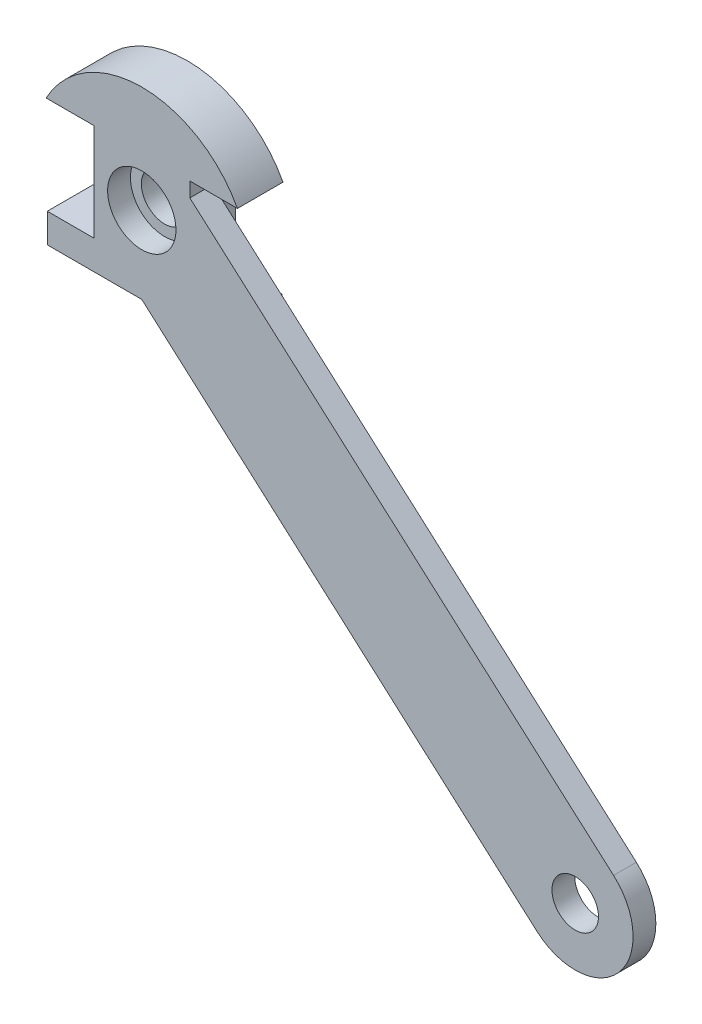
ISO-10303-21;
HEADER;
FILE_DESCRIPTION(('STEP AP214'),'2;1');
FILE_NAME('part.step','',(''),(''),'','','');
FILE_SCHEMA(('AUTOMOTIVE_DESIGN { 1 0 10303 214 1 1 1 1 }'));
ENDSEC;
DATA;
#1=APPLICATION_CONTEXT('core data for automotive mechanical design processes');
#2=APPLICATION_PROTOCOL_DEFINITION('international standard','automotive_design',2000,#1);
#3=PRODUCT_CONTEXT('',#1,'mechanical');
#4=PRODUCT('Part','Part','',(#3));
#5=PRODUCT_RELATED_PRODUCT_CATEGORY('part','',(#4));
#6=PRODUCT_DEFINITION_FORMATION('','',#4);
#7=PRODUCT_DEFINITION_CONTEXT('part definition',#1,'design');
#8=PRODUCT_DEFINITION('design','',#6,#7);
#9=PRODUCT_DEFINITION_SHAPE('','',#8);
#10=(LENGTH_UNIT() NAMED_UNIT(*) SI_UNIT(.MILLI.,.METRE.));
#11=(NAMED_UNIT(*) PLANE_ANGLE_UNIT() SI_UNIT($,.RADIAN.));
#12=(NAMED_UNIT(*) SI_UNIT($,.STERADIAN.) SOLID_ANGLE_UNIT());
#13=UNCERTAINTY_MEASURE_WITH_UNIT(LENGTH_MEASURE(1.E-05),#10,'distance_accuracy_value','');
#14=(GEOMETRIC_REPRESENTATION_CONTEXT(3) GLOBAL_UNCERTAINTY_ASSIGNED_CONTEXT((#13)) GLOBAL_UNIT_ASSIGNED_CONTEXT((#10,
#11,#12)) REPRESENTATION_CONTEXT('',''));
#15=CARTESIAN_POINT('',(0.,0.,0.));
#16=DIRECTION('',(0.,0.,1.));
#17=DIRECTION('',(1.,0.,0.));
#18=AXIS2_PLACEMENT_3D('',#15,#16,#17);
#19=CARTESIAN_POINT('',(-20.74,-16.94245,10.));
#20=DIRECTION('',(0.,1.,0.));
#21=DIRECTION('',(0.,0.,1.));
#22=AXIS2_PLACEMENT_3D('',#19,#20,#21);
#23=PLANE('',#22);
#24=DIRECTION('',(0.,0.,-1.));
#25=VECTOR('',#24,1.);
#26=CARTESIAN_POINT('',(-0.016382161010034,-16.94245,10.));
#27=LINE('',#26,#25);
#28=CARTESIAN_POINT('',(-0.0163821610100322,-16.94245,10.));
#29=VERTEX_POINT('',#28);
#30=CARTESIAN_POINT('',(-0.016382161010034,-16.94245,5.));
#31=VERTEX_POINT('',#30);
#32=EDGE_CURVE('E264',#29,#31,#27,.T.);
#33=ORIENTED_EDGE('',*,*,#32,.F.);
#34=DIRECTION('',(1.,0.,0.));
#35=VECTOR('',#34,1.);
#36=CARTESIAN_POINT('',(-20.74,-16.94245,10.));
#37=LINE('',#36,#35);
#38=CARTESIAN_POINT('',(-20.74,-16.94245,10.));
#39=VERTEX_POINT('',#38);
#40=EDGE_CURVE('E186',#39,#29,#37,.T.);
#41=ORIENTED_EDGE('',*,*,#40,.F.);
#42=DIRECTION('',(0.,0.,-1.));
#43=VECTOR('',#42,1.);
#44=CARTESIAN_POINT('',(-20.74,-16.94245,10.));
#45=LINE('',#44,#43);
#46=CARTESIAN_POINT('',(-20.74,-16.94245,0.));
#47=VERTEX_POINT('',#46);
#48=EDGE_CURVE('E40',#39,#47,#45,.T.);
#49=ORIENTED_EDGE('',*,*,#48,.T.);
#50=DIRECTION('',(1.,0.,0.));
#51=VECTOR('',#50,1.);
#52=CARTESIAN_POINT('',(-20.74,-16.94245,0.));
#53=LINE('',#52,#51);
#54=CARTESIAN_POINT('',(20.74,-16.94245,0.));
#55=VERTEX_POINT('',#54);
#56=EDGE_CURVE('E150',#47,#55,#53,.T.);
#57=ORIENTED_EDGE('',*,*,#56,.T.);
#58=DIRECTION('',(0.,0.,-1.));
#59=VECTOR('',#58,1.);
#60=CARTESIAN_POINT('',(20.74,-16.94245,10.));
#61=LINE('',#60,#59);
#62=CARTESIAN_POINT('',(20.74,-16.94245,5.));
#63=VERTEX_POINT('',#62);
#64=EDGE_CURVE('E178',#63,#55,#61,.T.);
#65=ORIENTED_EDGE('',*,*,#64,.F.);
#66=DIRECTION('',(-1.,0.,0.));
#67=VECTOR('',#66,1.);
#68=CARTESIAN_POINT('',(-20.74,-16.94245,5.));
#69=LINE('',#68,#67);
#70=EDGE_CURVE('E202',#63,#31,#69,.T.);
#71=ORIENTED_EDGE('',*,*,#70,.T.);
#72=EDGE_LOOP('',(#33,#41,#49,#57,#65,#71));
#73=FACE_BOUND('',#72,.T.);
#74=ADVANCED_FACE('F32',(#73),#23,.F.);
#75=CARTESIAN_POINT('',(10.54169,-10.5429,10.));
#76=DIRECTION('',(-1.,0.,0.));
#77=DIRECTION('',(0.,0.,1.));
#78=AXIS2_PLACEMENT_3D('',#75,#76,#77);
#79=PLANE('',#78);
#80=DIRECTION('',(0.,0.,1.));
#81=VECTOR('',#80,1.);
#82=CARTESIAN_POINT('',(10.54169,7.63044423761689,10.));
#83=LINE('',#82,#81);
#84=CARTESIAN_POINT('',(10.54169,7.63044423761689,5.));
#85=VERTEX_POINT('',#84);
#86=CARTESIAN_POINT('',(10.54169,7.63044423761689,10.));
#87=VERTEX_POINT('',#86);
#88=EDGE_CURVE('E261',#85,#87,#83,.T.);
#89=ORIENTED_EDGE('',*,*,#88,.F.);
#90=DIRECTION('',(0.,-1.,0.));
#91=VECTOR('',#90,1.);
#92=CARTESIAN_POINT('',(10.54169,-10.5429,5.));
#93=LINE('',#92,#91);
#94=CARTESIAN_POINT('',(10.54169,-10.5429,5.));
#95=VERTEX_POINT('',#94);
#96=EDGE_CURVE('E239',#85,#95,#93,.T.);
#97=ORIENTED_EDGE('',*,*,#96,.T.);
#98=DIRECTION('',(0.,0.,-1.));
#99=VECTOR('',#98,1.);
#100=CARTESIAN_POINT('',(10.54169,-10.5429,10.));
#101=LINE('',#100,#99);
#102=CARTESIAN_POINT('',(10.54169,-10.5429,0.));
#103=VERTEX_POINT('',#102);
#104=EDGE_CURVE('E174',#95,#103,#101,.T.);
#105=ORIENTED_EDGE('',*,*,#104,.T.);
#106=DIRECTION('',(0.,1.,0.));
#107=VECTOR('',#106,1.);
#108=CARTESIAN_POINT('',(10.54169,-10.5429,0.));
#109=LINE('',#108,#107);
#110=CARTESIAN_POINT('',(10.54169,10.84581,0.));
#111=VERTEX_POINT('',#110);
#112=EDGE_CURVE('E159',#103,#111,#109,.T.);
#113=ORIENTED_EDGE('',*,*,#112,.T.);
#114=DIRECTION('',(0.,0.,-1.));
#115=VECTOR('',#114,1.);
#116=CARTESIAN_POINT('',(10.54169,10.84581,10.));
#117=LINE('',#116,#115);
#118=CARTESIAN_POINT('',(10.54169,10.84581,10.));
#119=VERTEX_POINT('',#118);
#120=EDGE_CURVE('E171',#119,#111,#117,.T.);
#121=ORIENTED_EDGE('',*,*,#120,.F.);
#122=DIRECTION('',(0.,1.,0.));
#123=VECTOR('',#122,1.);
#124=CARTESIAN_POINT('',(10.54169,-10.5429,10.));
#125=LINE('',#124,#123);
#126=EDGE_CURVE('E271',#87,#119,#125,.T.);
#127=ORIENTED_EDGE('',*,*,#126,.F.);
#128=EDGE_LOOP('',(#89,#97,#105,#113,#121,#127));
#129=FACE_BOUND('',#128,.T.);
#130=ADVANCED_FACE('F276',(#129),#79,.F.);
#131=CARTESIAN_POINT('',(-20.74,-10.5429,10.));
#132=DIRECTION('',(0.,-1.,0.));
#133=DIRECTION('',(1.,0.,0.));
#134=AXIS2_PLACEMENT_3D('',#131,#132,#133);
#135=PLANE('',#134);
#136=DIRECTION('',(-1.,0.,0.));
#137=VECTOR('',#136,1.);
#138=CARTESIAN_POINT('',(-20.74,-10.5429,0.));
#139=LINE('',#138,#137);
#140=CARTESIAN_POINT('',(-10.54169,-10.5429,0.));
#141=VERTEX_POINT('',#140);
#142=CARTESIAN_POINT('',(-20.74,-10.5429,0.));
#143=VERTEX_POINT('',#142);
#144=EDGE_CURVE('E144',#141,#143,#139,.T.);
#145=ORIENTED_EDGE('',*,*,#144,.T.);
#146=DIRECTION('',(0.,0.,-1.));
#147=VECTOR('',#146,1.);
#148=CARTESIAN_POINT('',(-20.74,-10.5429,10.));
#149=LINE('',#148,#147);
#150=CARTESIAN_POINT('',(-20.74,-10.5429,10.));
#151=VERTEX_POINT('',#150);
#152=EDGE_CURVE('E11',#151,#143,#149,.T.);
#153=ORIENTED_EDGE('',*,*,#152,.F.);
#154=DIRECTION('',(-1.,0.,0.));
#155=VECTOR('',#154,1.);
#156=CARTESIAN_POINT('',(-20.74,-10.5429,10.));
#157=LINE('',#156,#155);
#158=CARTESIAN_POINT('',(-10.54169,-10.5429,10.));
#159=VERTEX_POINT('',#158);
#160=EDGE_CURVE('E167',#159,#151,#157,.T.);
#161=ORIENTED_EDGE('',*,*,#160,.F.);
#162=DIRECTION('',(0.,0.,-1.));
#163=VECTOR('',#162,1.);
#164=CARTESIAN_POINT('',(-10.54169,-10.5429,10.));
#165=LINE('',#164,#163);
#166=EDGE_CURVE('E140',#159,#141,#165,.T.);
#167=ORIENTED_EDGE('',*,*,#166,.T.);
#168=EDGE_LOOP('',(#145,#153,#161,#167));
#169=FACE_BOUND('',#168,.T.);
#170=ADVANCED_FACE('F34',(#169),#135,.F.);
#171=CARTESIAN_POINT('',(-20.74,-16.94245,10.));
#172=DIRECTION('',(1.,0.,0.));
#173=DIRECTION('',(0.,0.,-1.));
#174=AXIS2_PLACEMENT_3D('',#171,#172,#173);
#175=PLANE('',#174);
#176=DIRECTION('',(0.,-1.,0.));
#177=VECTOR('',#176,1.);
#178=CARTESIAN_POINT('',(-20.74,-16.94245,0.));
#179=LINE('',#178,#177);
#180=EDGE_CURVE('E147',#143,#47,#179,.T.);
#181=ORIENTED_EDGE('',*,*,#180,.T.);
#182=ORIENTED_EDGE('',*,*,#48,.F.);
#183=DIRECTION('',(0.,-1.,0.));
#184=VECTOR('',#183,1.);
#185=CARTESIAN_POINT('',(-20.74,-16.94245,10.));
#186=LINE('',#185,#184);
#187=EDGE_CURVE('E103',#151,#39,#186,.T.);
#188=ORIENTED_EDGE('',*,*,#187,.F.);
#189=ORIENTED_EDGE('',*,*,#152,.T.);
#190=EDGE_LOOP('',(#181,#182,#188,#189));
#191=FACE_BOUND('',#190,.T.);
#192=ADVANCED_FACE('F284',(#191),#175,.F.);
#193=CARTESIAN_POINT('',(20.74,-16.94245,10.));
#194=DIRECTION('',(-1.,0.,0.));
#195=DIRECTION('',(0.,0.,1.));
#196=AXIS2_PLACEMENT_3D('',#193,#194,#195);
#197=PLANE('',#196);
#198=DIRECTION('',(0.,0.,-1.));
#199=VECTOR('',#198,1.);
#200=CARTESIAN_POINT('',(20.74,-10.5429,10.));
#201=LINE('',#200,#199);
#202=CARTESIAN_POINT('',(20.74,-10.5429,5.));
#203=VERTEX_POINT('',#202);
#204=CARTESIAN_POINT('',(20.74,-10.5429,0.));
#205=VERTEX_POINT('',#204);
#206=EDGE_CURVE('E176',#203,#205,#201,.T.);
#207=ORIENTED_EDGE('',*,*,#206,.F.);
#208=DIRECTION('',(0.,-1.,0.));
#209=VECTOR('',#208,1.);
#210=CARTESIAN_POINT('',(20.74,-16.94245,5.));
#211=LINE('',#210,#209);
#212=EDGE_CURVE('E198',#203,#63,#211,.T.);
#213=ORIENTED_EDGE('',*,*,#212,.T.);
#214=ORIENTED_EDGE('',*,*,#64,.T.);
#215=DIRECTION('',(0.,1.,0.));
#216=VECTOR('',#215,1.);
#217=CARTESIAN_POINT('',(20.74,-16.94245,0.));
#218=LINE('',#217,#216);
#219=EDGE_CURVE('E153',#55,#205,#218,.T.);
#220=ORIENTED_EDGE('',*,*,#219,.T.);
#221=EDGE_LOOP('',(#207,#213,#214,#220));
#222=FACE_BOUND('',#221,.T.);
#223=ADVANCED_FACE('F194',(#222),#197,.F.);
#224=CARTESIAN_POINT('',(20.74,-10.5429,10.));
#225=DIRECTION('',(0.,-1.,0.));
#226=DIRECTION('',(1.,0.,0.));
#227=AXIS2_PLACEMENT_3D('',#224,#225,#226);
#228=PLANE('',#227);
#229=ORIENTED_EDGE('',*,*,#104,.F.);
#230=DIRECTION('',(1.,0.,0.));
#231=VECTOR('',#230,1.);
#232=CARTESIAN_POINT('',(20.74,-10.5429,5.));
#233=LINE('',#232,#231);
#234=EDGE_CURVE('E47',#95,#203,#233,.T.);
#235=ORIENTED_EDGE('',*,*,#234,.T.);
#236=ORIENTED_EDGE('',*,*,#206,.T.);
#237=DIRECTION('',(-1.,0.,0.));
#238=VECTOR('',#237,1.);
#239=CARTESIAN_POINT('',(20.74,-10.5429,0.));
#240=LINE('',#239,#238);
#241=EDGE_CURVE('E156',#205,#103,#240,.T.);
#242=ORIENTED_EDGE('',*,*,#241,.T.);
#243=EDGE_LOOP('',(#229,#235,#236,#242));
#244=FACE_BOUND('',#243,.T.);
#245=ADVANCED_FACE('F290',(#244),#228,.F.);
#246=CARTESIAN_POINT('',(10.54169,10.84581,10.));
#247=DIRECTION('',(0.,1.,0.));
#248=DIRECTION('',(0.,0.,1.));
#249=AXIS2_PLACEMENT_3D('',#246,#247,#248);
#250=PLANE('',#249);
#251=DIRECTION('',(1.,0.,0.));
#252=VECTOR('',#251,1.);
#253=CARTESIAN_POINT('',(10.54169,10.84581,0.));
#254=LINE('',#253,#252);
#255=CARTESIAN_POINT('',(20.99169,10.84581,0.));
#256=VERTEX_POINT('',#255);
#257=EDGE_CURVE('E161',#111,#256,#254,.T.);
#258=ORIENTED_EDGE('',*,*,#257,.T.);
#259=DIRECTION('',(0.,0.,-1.));
#260=VECTOR('',#259,1.);
#261=CARTESIAN_POINT('',(20.99169,10.84581,10.));
#262=LINE('',#261,#260);
#263=CARTESIAN_POINT('',(20.99169,10.84581,10.));
#264=VERTEX_POINT('',#263);
#265=EDGE_CURVE('E135',#264,#256,#262,.T.);
#266=ORIENTED_EDGE('',*,*,#265,.F.);
#267=DIRECTION('',(1.,0.,0.));
#268=VECTOR('',#267,1.);
#269=CARTESIAN_POINT('',(10.54169,10.84581,10.));
#270=LINE('',#269,#268);
#271=EDGE_CURVE('E123',#119,#264,#270,.T.);
#272=ORIENTED_EDGE('',*,*,#271,.F.);
#273=ORIENTED_EDGE('',*,*,#120,.T.);
#274=EDGE_LOOP('',(#258,#266,#272,#273));
#275=FACE_BOUND('',#274,.T.);
#276=ADVANCED_FACE('F279',(#275),#250,.F.);
#277=CARTESIAN_POINT('',(0.,-0.369757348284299,10.));
#278=DIRECTION('',(0.,0.,-1.));
#279=DIRECTION('',(-1.,0.,0.));
#280=AXIS2_PLACEMENT_3D('',#277,#278,#279);
#281=CYLINDRICAL_SURFACE('',#280,23.8);
#282=CARTESIAN_POINT('',(0.,-0.369757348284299,0.));
#283=DIRECTION('',(0.,0.,1.));
#284=DIRECTION('',(1.,0.,0.));
#285=AXIS2_PLACEMENT_3D('',#282,#283,#284);
#286=CIRCLE('',#285,23.8);
#287=CARTESIAN_POINT('',(-20.99169,10.84581,0.));
#288=VERTEX_POINT('',#287);
#289=EDGE_CURVE('E132',#256,#288,#286,.T.);
#290=ORIENTED_EDGE('',*,*,#289,.T.);
#291=DIRECTION('',(0.,0.,-1.));
#292=VECTOR('',#291,1.);
#293=CARTESIAN_POINT('',(-20.99169,10.84581,10.));
#294=LINE('',#293,#292);
#295=CARTESIAN_POINT('',(-20.99169,10.84581,10.));
#296=VERTEX_POINT('',#295);
#297=EDGE_CURVE('E129',#296,#288,#294,.T.);
#298=ORIENTED_EDGE('',*,*,#297,.F.);
#299=CARTESIAN_POINT('',(0.,-0.369757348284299,10.));
#300=DIRECTION('',(0.,0.,1.));
#301=DIRECTION('',(1.,0.,0.));
#302=AXIS2_PLACEMENT_3D('',#299,#300,#301);
#303=CIRCLE('',#302,23.8);
#304=EDGE_CURVE('E115',#264,#296,#303,.T.);
#305=ORIENTED_EDGE('',*,*,#304,.F.);
#306=ORIENTED_EDGE('',*,*,#265,.T.);
#307=EDGE_LOOP('',(#290,#298,#305,#306));
#308=FACE_BOUND('',#307,.T.);
#309=ADVANCED_FACE('F130',(#308),#281,.T.);
#310=CARTESIAN_POINT('',(-10.54169,10.84581,10.));
#311=DIRECTION('',(0.,1.,0.));
#312=DIRECTION('',(0.,0.,1.));
#313=AXIS2_PLACEMENT_3D('',#310,#311,#312);
#314=PLANE('',#313);
#315=DIRECTION('',(1.,0.,0.));
#316=VECTOR('',#315,1.);
#317=CARTESIAN_POINT('',(-10.54169,10.84581,0.));
#318=LINE('',#317,#316);
#319=CARTESIAN_POINT('',(-10.54169,10.84581,0.));
#320=VERTEX_POINT('',#319);
#321=EDGE_CURVE('E164',#288,#320,#318,.T.);
#322=ORIENTED_EDGE('',*,*,#321,.T.);
#323=DIRECTION('',(0.,0.,-1.));
#324=VECTOR('',#323,1.);
#325=CARTESIAN_POINT('',(-10.54169,10.84581,10.));
#326=LINE('',#325,#324);
#327=CARTESIAN_POINT('',(-10.54169,10.84581,10.));
#328=VERTEX_POINT('',#327);
#329=EDGE_CURVE('E136',#328,#320,#326,.T.);
#330=ORIENTED_EDGE('',*,*,#329,.F.);
#331=DIRECTION('',(1.,0.,0.));
#332=VECTOR('',#331,1.);
#333=CARTESIAN_POINT('',(-10.54169,10.84581,10.));
#334=LINE('',#333,#332);
#335=EDGE_CURVE('E120',#296,#328,#334,.T.);
#336=ORIENTED_EDGE('',*,*,#335,.F.);
#337=ORIENTED_EDGE('',*,*,#297,.T.);
#338=EDGE_LOOP('',(#322,#330,#336,#337));
#339=FACE_BOUND('',#338,.T.);
#340=ADVANCED_FACE('F138',(#339),#314,.F.);
#341=CARTESIAN_POINT('',(-10.54169,-10.5429,10.));
#342=DIRECTION('',(1.,0.,0.));
#343=DIRECTION('',(0.,0.,-1.));
#344=AXIS2_PLACEMENT_3D('',#341,#342,#343);
#345=PLANE('',#344);
#346=DIRECTION('',(0.,-1.,0.));
#347=VECTOR('',#346,1.);
#348=CARTESIAN_POINT('',(-10.54169,-10.5429,0.));
#349=LINE('',#348,#347);
#350=EDGE_CURVE('E95',#320,#141,#349,.T.);
#351=ORIENTED_EDGE('',*,*,#350,.T.);
#352=ORIENTED_EDGE('',*,*,#166,.F.);
#353=DIRECTION('',(0.,-1.,0.));
#354=VECTOR('',#353,1.);
#355=CARTESIAN_POINT('',(-10.54169,-10.5429,10.));
#356=LINE('',#355,#354);
#357=EDGE_CURVE('E56',#328,#159,#356,.T.);
#358=ORIENTED_EDGE('',*,*,#357,.F.);
#359=ORIENTED_EDGE('',*,*,#329,.T.);
#360=EDGE_LOOP('',(#351,#352,#358,#359));
#361=FACE_BOUND('',#360,.T.);
#362=ADVANCED_FACE('F280',(#361),#345,.F.);
#363=CARTESIAN_POINT('',(0.,-0.369757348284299,10.));
#364=DIRECTION('',(0.,0.,1.));
#365=DIRECTION('',(1.,0.,0.));
#366=AXIS2_PLACEMENT_3D('',#363,#364,#365);
#367=PLANE('',#366);
#368=CARTESIAN_POINT('',(0.,0.,10.));
#369=DIRECTION('',(0.,0.,1.));
#370=DIRECTION('',(1.,0.,0.));
#371=AXIS2_PLACEMENT_3D('',#368,#369,#370);
#372=CIRCLE('',#371,7.5);
#373=CARTESIAN_POINT('',(7.5,0.,10.));
#374=VERTEX_POINT('',#373);
#375=EDGE_CURVE('E353',#374,#374,#372,.T.);
#376=ORIENTED_EDGE('',*,*,#375,.F.);
#377=EDGE_LOOP('',(#376));
#378=FACE_BOUND('',#377,.T.);
#379=CARTESIAN_POINT('',(95.1173765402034,-84.1527461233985,10.));
#380=DIRECTION('',(0.,0.,1.));
#381=DIRECTION('',(1.,0.,0.));
#382=AXIS2_PLACEMENT_3D('',#379,#380,#381);
#383=CIRCLE('',#382,5.1);
#384=CARTESIAN_POINT('',(100.217376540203,-84.1527461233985,10.));
#385=VERTEX_POINT('',#384);
#386=EDGE_CURVE('E252',#385,#385,#383,.T.);
#387=ORIENTED_EDGE('',*,*,#386,.F.);
#388=EDGE_LOOP('',(#387));
#389=FACE_BOUND('',#388,.T.);
#390=ORIENTED_EDGE('',*,*,#40,.T.);
#391=DIRECTION('',(0.748955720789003,-0.662620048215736,0.));
#392=VECTOR('',#391,1.);
#393=CARTESIAN_POINT('',(-7.97225020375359,-9.90369254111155,10.));
#394=LINE('',#393,#392);
#395=CARTESIAN_POINT('',(86.7021019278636,-93.6644837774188,10.));
#396=VERTEX_POINT('',#395);
#397=EDGE_CURVE('E224',#29,#396,#394,.T.);
#398=ORIENTED_EDGE('',*,*,#397,.T.);
#399=CARTESIAN_POINT('',(95.1173765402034,-84.1527461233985,10.));
#400=DIRECTION('',(0.,0.,1.));
#401=DIRECTION('',(-1.,0.,0.));
#402=AXIS2_PLACEMENT_3D('',#399,#400,#401);
#403=CIRCLE('',#402,12.7);
#404=CARTESIAN_POINT('',(103.532651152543,-74.6410084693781,10.));
#405=VERTEX_POINT('',#404);
#406=EDGE_CURVE('E228',#396,#405,#403,.T.);
#407=ORIENTED_EDGE('',*,*,#406,.T.);
#408=DIRECTION('',(-0.748955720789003,0.662620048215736,0.));
#409=VECTOR('',#408,1.);
#410=CARTESIAN_POINT('',(8.8582990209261,9.11978276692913,10.));
#411=LINE('',#410,#409);
#412=EDGE_CURVE('E245',#405,#87,#411,.T.);
#413=ORIENTED_EDGE('',*,*,#412,.T.);
#414=ORIENTED_EDGE('',*,*,#126,.T.);
#415=ORIENTED_EDGE('',*,*,#271,.T.);
#416=ORIENTED_EDGE('',*,*,#304,.T.);
#417=ORIENTED_EDGE('',*,*,#335,.T.);
#418=ORIENTED_EDGE('',*,*,#357,.T.);
#419=ORIENTED_EDGE('',*,*,#160,.T.);
#420=ORIENTED_EDGE('',*,*,#187,.T.);
#421=EDGE_LOOP('',(#390,#398,#407,#413,#414,#415,#416,#417,#418,#419,#420));
#422=FACE_BOUND('',#421,.T.);
#423=ADVANCED_FACE('F118',(#378,#389,#422),#367,.T.);
#424=CARTESIAN_POINT('',(0.,-0.369757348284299,0.));
#425=DIRECTION('',(0.,0.,1.));
#426=DIRECTION('',(1.,0.,0.));
#427=AXIS2_PLACEMENT_3D('',#424,#425,#426);
#428=PLANE('',#427);
#429=CARTESIAN_POINT('',(0.,0.,0.));
#430=DIRECTION('',(0.,0.,1.));
#431=DIRECTION('',(1.,0.,0.));
#432=AXIS2_PLACEMENT_3D('',#429,#430,#431);
#433=CIRCLE('',#432,5.1);
#434=CARTESIAN_POINT('',(5.1,0.,0.));
#435=VERTEX_POINT('',#434);
#436=EDGE_CURVE('E148',#435,#435,#433,.T.);
#437=ORIENTED_EDGE('',*,*,#436,.T.);
#438=EDGE_LOOP('',(#437));
#439=FACE_BOUND('',#438,.T.);
#440=ORIENTED_EDGE('',*,*,#144,.F.);
#441=ORIENTED_EDGE('',*,*,#350,.F.);
#442=ORIENTED_EDGE('',*,*,#321,.F.);
#443=ORIENTED_EDGE('',*,*,#289,.F.);
#444=ORIENTED_EDGE('',*,*,#257,.F.);
#445=ORIENTED_EDGE('',*,*,#112,.F.);
#446=ORIENTED_EDGE('',*,*,#241,.F.);
#447=ORIENTED_EDGE('',*,*,#219,.F.);
#448=ORIENTED_EDGE('',*,*,#56,.F.);
#449=ORIENTED_EDGE('',*,*,#180,.F.);
#450=EDGE_LOOP('',(#440,#441,#442,#443,#444,#445,#446,#447,#448,#449));
#451=FACE_BOUND('',#450,.T.);
#452=ADVANCED_FACE('F189',(#439,#451),#428,.F.);
#453=CARTESIAN_POINT('',(0.,0.,0.));
#454=DIRECTION('',(0.,0.,1.));
#455=DIRECTION('',(1.,0.,0.));
#456=AXIS2_PLACEMENT_3D('',#453,#454,#455);
#457=CYLINDRICAL_SURFACE('',#456,5.1);
#458=CARTESIAN_POINT('',(0.,0.,5.));
#459=DIRECTION('',(0.,0.,1.));
#460=DIRECTION('',(1.,0.,0.));
#461=AXIS2_PLACEMENT_3D('',#458,#459,#460);
#462=CIRCLE('',#461,5.1);
#463=CARTESIAN_POINT('',(5.1,0.,5.));
#464=VERTEX_POINT('',#463);
#465=EDGE_CURVE('E351',#464,#464,#462,.F.);
#466=ORIENTED_EDGE('',*,*,#465,.F.);
#467=EDGE_LOOP('',(#466));
#468=FACE_BOUND('',#467,.T.);
#469=ORIENTED_EDGE('',*,*,#436,.F.);
#470=EDGE_LOOP('',(#469));
#471=FACE_BOUND('',#470,.T.);
#472=ADVANCED_FACE('F312',(#468,#471),#457,.F.);
#473=CARTESIAN_POINT('',(-7.97225020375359,-9.90369254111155,10.));
#474=DIRECTION('',(0.662620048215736,0.748955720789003,0.));
#475=DIRECTION('',(-0.748955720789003,0.662620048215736,0.));
#476=AXIS2_PLACEMENT_3D('',#473,#474,#475);
#477=PLANE('',#476);
#478=ORIENTED_EDGE('',*,*,#397,.F.);
#479=ORIENTED_EDGE('',*,*,#32,.T.);
#480=DIRECTION('',(0.748955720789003,-0.662620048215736,0.));
#481=VECTOR('',#480,1.);
#482=CARTESIAN_POINT('',(-7.97225020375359,-9.90369254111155,5.));
#483=LINE('',#482,#481);
#484=CARTESIAN_POINT('',(86.7021019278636,-93.6644837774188,5.));
#485=VERTEX_POINT('',#484);
#486=EDGE_CURVE('E236',#31,#485,#483,.T.);
#487=ORIENTED_EDGE('',*,*,#486,.T.);
#488=DIRECTION('',(0.,0.,-1.));
#489=VECTOR('',#488,1.);
#490=CARTESIAN_POINT('',(86.7021019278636,-93.6644837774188,10.));
#491=LINE('',#490,#489);
#492=EDGE_CURVE('E234',#396,#485,#491,.T.);
#493=ORIENTED_EDGE('',*,*,#492,.F.);
#494=EDGE_LOOP('',(#478,#479,#487,#493));
#495=FACE_BOUND('',#494,.T.);
#496=ADVANCED_FACE('F235',(#495),#477,.F.);
#497=CARTESIAN_POINT('',(8.8582990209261,9.11978276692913,10.));
#498=DIRECTION('',(-0.662620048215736,-0.748955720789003,0.));
#499=DIRECTION('',(0.748955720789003,-0.662620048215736,0.));
#500=AXIS2_PLACEMENT_3D('',#497,#498,#499);
#501=PLANE('',#500);
#502=DIRECTION('',(-0.748955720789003,0.662620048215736,0.));
#503=VECTOR('',#502,1.);
#504=CARTESIAN_POINT('',(8.8582990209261,9.11978276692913,5.));
#505=LINE('',#504,#503);
#506=CARTESIAN_POINT('',(103.532651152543,-74.6410084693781,5.));
#507=VERTEX_POINT('',#506);
#508=EDGE_CURVE('E231',#507,#85,#505,.T.);
#509=ORIENTED_EDGE('',*,*,#508,.T.);
#510=ORIENTED_EDGE('',*,*,#88,.T.);
#511=ORIENTED_EDGE('',*,*,#412,.F.);
#512=DIRECTION('',(0.,0.,-1.));
#513=VECTOR('',#512,1.);
#514=CARTESIAN_POINT('',(103.532651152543,-74.6410084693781,10.));
#515=LINE('',#514,#513);
#516=EDGE_CURVE('E240',#405,#507,#515,.T.);
#517=ORIENTED_EDGE('',*,*,#516,.T.);
#518=EDGE_LOOP('',(#509,#510,#511,#517));
#519=FACE_BOUND('',#518,.T.);
#520=ADVANCED_FACE('F322',(#519),#501,.F.);
#521=CARTESIAN_POINT('',(2.90202083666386,-2.56749115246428,5.));
#522=DIRECTION('',(0.,0.,-1.));
#523=DIRECTION('',(-1.,0.,0.));
#524=AXIS2_PLACEMENT_3D('',#521,#522,#523);
#525=PLANE('',#524);
#526=CARTESIAN_POINT('',(95.1173765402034,-84.1527461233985,5.));
#527=DIRECTION('',(0.,0.,1.));
#528=DIRECTION('',(1.,0.,0.));
#529=AXIS2_PLACEMENT_3D('',#526,#527,#528);
#530=CIRCLE('',#529,5.1);
#531=CARTESIAN_POINT('',(100.217376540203,-84.1527461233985,5.));
#532=VERTEX_POINT('',#531);
#533=EDGE_CURVE('E352',#532,#532,#530,.T.);
#534=ORIENTED_EDGE('',*,*,#533,.T.);
#535=EDGE_LOOP('',(#534));
#536=FACE_BOUND('',#535,.T.);
#537=ORIENTED_EDGE('',*,*,#70,.F.);
#538=ORIENTED_EDGE('',*,*,#212,.F.);
#539=ORIENTED_EDGE('',*,*,#234,.F.);
#540=ORIENTED_EDGE('',*,*,#96,.F.);
#541=ORIENTED_EDGE('',*,*,#508,.F.);
#542=CARTESIAN_POINT('',(95.1173765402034,-84.1527461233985,5.));
#543=DIRECTION('',(0.,0.,1.));
#544=DIRECTION('',(-1.,0.,0.));
#545=AXIS2_PLACEMENT_3D('',#542,#543,#544);
#546=CIRCLE('',#545,12.7);
#547=EDGE_CURVE('E251',#485,#507,#546,.T.);
#548=ORIENTED_EDGE('',*,*,#547,.F.);
#549=ORIENTED_EDGE('',*,*,#486,.F.);
#550=EDGE_LOOP('',(#537,#538,#539,#540,#541,#548,#549));
#551=FACE_BOUND('',#550,.T.);
#552=ADVANCED_FACE('F326',(#536,#551),#525,.T.);
#553=CARTESIAN_POINT('',(95.1173765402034,-84.1527461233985,10.));
#554=DIRECTION('',(0.,0.,-1.));
#555=DIRECTION('',(-1.,0.,0.));
#556=AXIS2_PLACEMENT_3D('',#553,#554,#555);
#557=CYLINDRICAL_SURFACE('',#556,12.7);
#558=ORIENTED_EDGE('',*,*,#547,.T.);
#559=ORIENTED_EDGE('',*,*,#516,.F.);
#560=ORIENTED_EDGE('',*,*,#406,.F.);
#561=ORIENTED_EDGE('',*,*,#492,.T.);
#562=EDGE_LOOP('',(#558,#559,#560,#561));
#563=FACE_BOUND('',#562,.T.);
#564=ADVANCED_FACE('F242',(#563),#557,.T.);
#565=CARTESIAN_POINT('',(95.1173765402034,-84.1527461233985,10.));
#566=DIRECTION('',(0.,0.,-1.));
#567=DIRECTION('',(-1.,0.,0.));
#568=AXIS2_PLACEMENT_3D('',#565,#566,#567);
#569=CYLINDRICAL_SURFACE('',#568,5.1);
#570=ORIENTED_EDGE('',*,*,#386,.T.);
#571=EDGE_LOOP('',(#570));
#572=FACE_BOUND('',#571,.T.);
#573=ORIENTED_EDGE('',*,*,#533,.F.);
#574=EDGE_LOOP('',(#573));
#575=FACE_BOUND('',#574,.T.);
#576=ADVANCED_FACE('F325',(#572,#575),#569,.F.);
#577=CARTESIAN_POINT('',(0.,0.,5.));
#578=DIRECTION('',(0.,0.,1.));
#579=DIRECTION('',(1.,0.,0.));
#580=AXIS2_PLACEMENT_3D('',#577,#578,#579);
#581=PLANE('',#580);
#582=CARTESIAN_POINT('',(0.,0.,5.));
#583=DIRECTION('',(0.,0.,1.));
#584=DIRECTION('',(1.,0.,0.));
#585=AXIS2_PLACEMENT_3D('',#582,#583,#584);
#586=CIRCLE('',#585,7.5);
#587=CARTESIAN_POINT('',(7.5,0.,5.));
#588=VERTEX_POINT('',#587);
#589=EDGE_CURVE('E348',#588,#588,#586,.T.);
#590=ORIENTED_EDGE('',*,*,#589,.T.);
#591=EDGE_LOOP('',(#590));
#592=FACE_BOUND('',#591,.T.);
#593=ORIENTED_EDGE('',*,*,#465,.T.);
#594=EDGE_LOOP('',(#593));
#595=FACE_BOUND('',#594,.T.);
#596=ADVANCED_FACE('F335',(#592,#595),#581,.T.);
#597=CARTESIAN_POINT('',(0.,0.,10.));
#598=DIRECTION('',(0.,0.,-1.));
#599=DIRECTION('',(-1.,0.,0.));
#600=AXIS2_PLACEMENT_3D('',#597,#598,#599);
#601=CYLINDRICAL_SURFACE('',#600,7.5);
#602=ORIENTED_EDGE('',*,*,#375,.T.);
#603=EDGE_LOOP('',(#602));
#604=FACE_BOUND('',#603,.T.);
#605=ORIENTED_EDGE('',*,*,#589,.F.);
#606=EDGE_LOOP('',(#605));
#607=FACE_BOUND('',#606,.T.);
#608=ADVANCED_FACE('F337',(#604,#607),#601,.F.);
#609=CLOSED_SHELL('',(#74,#130,#170,#192,#223,#245,#276,#309,#340,#362,#423,#452,#472,#496,#520,
#552,#564,#576,#596,#608));
#610=MANIFOLD_SOLID_BREP('B2',#609);
#611=ADVANCED_BREP_SHAPE_REPRESENTATION('',(#18,#610),#14);
#612=SHAPE_DEFINITION_REPRESENTATION(#9,#611);
ENDSEC;
END-ISO-10303-21;
